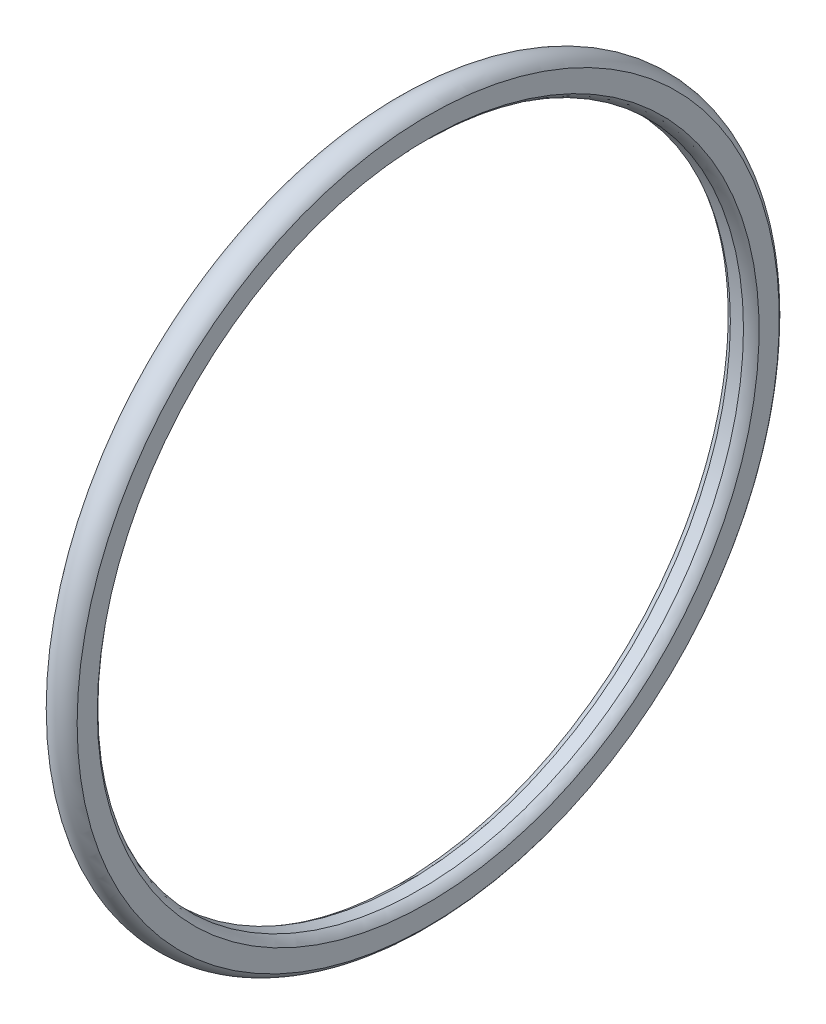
ISO-10303-21;
HEADER;
FILE_DESCRIPTION(('STEP AP214'),'2;1');
FILE_NAME('part.step','',(''),(''),'','','');
FILE_SCHEMA(('AUTOMOTIVE_DESIGN { 1 0 10303 214 1 1 1 1 }'));
ENDSEC;
DATA;
#1=APPLICATION_CONTEXT('core data for automotive mechanical design processes');
#2=APPLICATION_PROTOCOL_DEFINITION('international standard','automotive_design',2000,#1);
#3=PRODUCT_CONTEXT('',#1,'mechanical');
#4=PRODUCT('Part','Part','',(#3));
#5=PRODUCT_RELATED_PRODUCT_CATEGORY('part','',(#4));
#6=PRODUCT_DEFINITION_FORMATION('','',#4);
#7=PRODUCT_DEFINITION_CONTEXT('part definition',#1,'design');
#8=PRODUCT_DEFINITION('design','',#6,#7);
#9=PRODUCT_DEFINITION_SHAPE('','',#8);
#10=(LENGTH_UNIT() NAMED_UNIT(*) SI_UNIT(.MILLI.,.METRE.));
#11=(NAMED_UNIT(*) PLANE_ANGLE_UNIT() SI_UNIT($,.RADIAN.));
#12=(NAMED_UNIT(*) SI_UNIT($,.STERADIAN.) SOLID_ANGLE_UNIT());
#13=UNCERTAINTY_MEASURE_WITH_UNIT(LENGTH_MEASURE(1.E-05),#10,'distance_accuracy_value','');
#14=(GEOMETRIC_REPRESENTATION_CONTEXT(3) GLOBAL_UNCERTAINTY_ASSIGNED_CONTEXT((#13)) GLOBAL_UNIT_ASSIGNED_CONTEXT((#10,
#11,#12)) REPRESENTATION_CONTEXT('',''));
#15=CARTESIAN_POINT('',(0.,0.,0.));
#16=DIRECTION('',(0.,0.,1.));
#17=DIRECTION('',(1.,0.,0.));
#18=AXIS2_PLACEMENT_3D('',#15,#16,#17);
#19=CARTESIAN_POINT('',(-50.,0.,0.));
#20=DIRECTION('',(-1.,0.,0.));
#21=DIRECTION('',(0.,0.,1.));
#22=AXIS2_PLACEMENT_3D('',#19,#20,#21);
#23=CYLINDRICAL_SURFACE('',#22,53.2);
#24=CARTESIAN_POINT('',(-11.0770329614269,0.,0.));
#25=DIRECTION('',(-1.,0.,0.));
#26=DIRECTION('',(0.,0.,1.));
#27=AXIS2_PLACEMENT_3D('',#24,#25,#26);
#28=CIRCLE('',#27,53.2);
#29=CARTESIAN_POINT('',(-11.0770329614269,0.,53.2));
#30=VERTEX_POINT('',#29);
#31=EDGE_CURVE('E44',#30,#30,#28,.T.);
#32=ORIENTED_EDGE('',*,*,#31,.T.);
#33=EDGE_LOOP('',(#32));
#34=FACE_BOUND('',#33,.T.);
#35=CARTESIAN_POINT('',(-8.92296703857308,0.,0.));
#36=DIRECTION('',(-1.,0.,0.));
#37=DIRECTION('',(0.,0.,1.));
#38=AXIS2_PLACEMENT_3D('',#35,#36,#37);
#39=CIRCLE('',#38,53.2);
#40=CARTESIAN_POINT('',(-8.92296703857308,0.,53.2));
#41=VERTEX_POINT('',#40);
#42=EDGE_CURVE('E10',#41,#41,#39,.T.);
#43=ORIENTED_EDGE('',*,*,#42,.F.);
#44=EDGE_LOOP('',(#43));
#45=FACE_BOUND('',#44,.T.);
#46=ADVANCED_FACE('F30',(#34,#45),#23,.F.);
#47=CARTESIAN_POINT('',(-10.,0.,0.));
#48=DIRECTION('',(-1.,0.,0.));
#49=DIRECTION('',(0.,0.,1.));
#50=AXIS2_PLACEMENT_3D('',#47,#48,#49);
#51=TOROIDAL_SURFACE('',#50,56.,3.);
#52=CARTESIAN_POINT('',(-7.5,0.,0.));
#53=DIRECTION('',(-1.,0.,0.));
#54=DIRECTION('',(0.,0.,1.));
#55=AXIS2_PLACEMENT_3D('',#52,#53,#54);
#56=CIRCLE('',#55,54.3416876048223);
#57=CARTESIAN_POINT('',(-7.5,0.,54.3416876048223));
#58=VERTEX_POINT('',#57);
#59=EDGE_CURVE('E36',#58,#58,#56,.T.);
#60=ORIENTED_EDGE('',*,*,#59,.F.);
#61=EDGE_LOOP('',(#60));
#62=FACE_BOUND('',#61,.T.);
#63=ORIENTED_EDGE('',*,*,#42,.T.);
#64=EDGE_LOOP('',(#63));
#65=FACE_BOUND('',#64,.T.);
#66=ADVANCED_FACE('F60',(#62,#65),#51,.T.);
#67=CARTESIAN_POINT('',(-7.5,57.6583123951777,0.));
#68=DIRECTION('',(1.,0.,0.));
#69=DIRECTION('',(0.,0.,-1.));
#70=AXIS2_PLACEMENT_3D('',#67,#68,#69);
#71=PLANE('',#70);
#72=ORIENTED_EDGE('',*,*,#59,.T.);
#73=EDGE_LOOP('',(#72));
#74=FACE_BOUND('',#73,.T.);
#75=CARTESIAN_POINT('',(-7.5,0.,0.));
#76=DIRECTION('',(-1.,0.,0.));
#77=DIRECTION('',(0.,0.,1.));
#78=AXIS2_PLACEMENT_3D('',#75,#76,#77);
#79=CIRCLE('',#78,57.6583123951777);
#80=CARTESIAN_POINT('',(-7.5,0.,57.6583123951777));
#81=VERTEX_POINT('',#80);
#82=EDGE_CURVE('E40',#81,#81,#79,.T.);
#83=ORIENTED_EDGE('',*,*,#82,.F.);
#84=EDGE_LOOP('',(#83));
#85=FACE_BOUND('',#84,.T.);
#86=ADVANCED_FACE('F55',(#74,#85),#71,.T.);
#87=CARTESIAN_POINT('',(-10.,0.,0.));
#88=DIRECTION('',(-1.,0.,0.));
#89=DIRECTION('',(0.,0.,1.));
#90=AXIS2_PLACEMENT_3D('',#87,#88,#89);
#91=TOROIDAL_SURFACE('',#90,56.,3.);
#92=ORIENTED_EDGE('',*,*,#31,.F.);
#93=EDGE_LOOP('',(#92));
#94=FACE_BOUND('',#93,.T.);
#95=ORIENTED_EDGE('',*,*,#82,.T.);
#96=EDGE_LOOP('',(#95));
#97=FACE_BOUND('',#96,.T.);
#98=ADVANCED_FACE('F52',(#94,#97),#91,.T.);
#99=CLOSED_SHELL('',(#46,#66,#86,#98));
#100=MANIFOLD_SOLID_BREP('B2',#99);
#101=ADVANCED_BREP_SHAPE_REPRESENTATION('',(#18,#100),#14);
#102=SHAPE_DEFINITION_REPRESENTATION(#9,#101);
ENDSEC;
END-ISO-10303-21;
